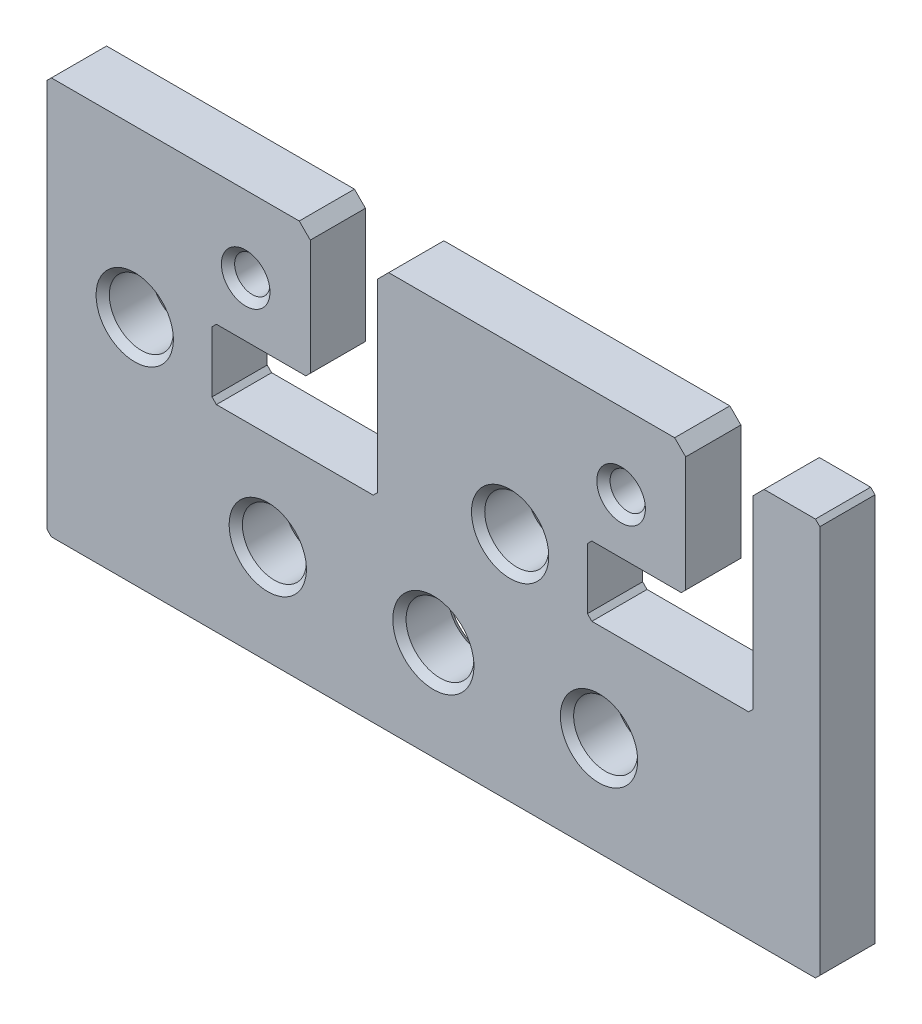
from build123d import *

# Parameters (mm, degrees)
SKETCH_1_R          = 3.075
SKETCH_1_R_2        = 2.9
SKETCH_1_R_3        = 1.6
EXTRUDE_1_DEPTH     = 5
CHAMFER_2_SIZE      = 0.4
CHAMFER_3_SIZE      = 1
CHAMFER_5_SIZE      = 0.4
SKETCH_2_R          = 1.4
CUT_EXTRUDE_1_DEPTH = 10
CHAMFER_4_SIZE      = 0.6


with BuildPart() as part:
    # Sketch 1 → Extrude 1 (new body)
    with BuildSketch(Plane.XY):
        Polygon((-14.098098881, -2.622176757), (55.901901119, -2.622176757), (55.901901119, 33.377823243), (49.851901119, 33.377823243), (49.851901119, 15.227823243), (34.851901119, 15.227823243), (34.851901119, 21.527823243), (43.751901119, 21.527823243), (43.751901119, 33.377823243), (15.851901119, 33.377823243), (15.851901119, 15.227823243), (0.851901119, 15.227823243), (0.851901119, 21.527823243), (9.751901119, 21.527823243), (9.751901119, 33.377823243), (-14.098098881, 33.377823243), align=None)
        with Locations((20.901901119, 6.377823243)):
            Circle(SKETCH_1_R, mode=Mode.SUBTRACT)
        with Locations((35.901901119, 6.377823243)):
            Circle(SKETCH_1_R_2, mode=Mode.SUBTRACT)
        with Locations((5.901901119, 6.377823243)):
            Circle(SKETCH_1_R_2, mode=Mode.SUBTRACT)
        with Locations((3.901901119, 26.477823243)):
            Circle(SKETCH_1_R_3, mode=Mode.SUBTRACT)
        with Locations((37.901901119, 26.477823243)):
            Circle(SKETCH_1_R_3, mode=Mode.SUBTRACT)
        with Locations((27.851901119, 18.377823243)):
            Circle(SKETCH_1_R_2, mode=Mode.SUBTRACT)
        with Locations((-6.148098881, 18.377823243)):
            Circle(SKETCH_1_R_2, mode=Mode.SUBTRACT)
    extrude(amount=EXTRUDE_1_DEPTH)

    # Chamfer 2
    chamfer_2_edges = [part.edges().sort_by_distance(p)[0] for p in [
        (-14.098098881, 33.377823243, 2.5),
        (9.751901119, 21.527823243, 2.5),
        (43.751901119, 21.527823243, 2.5),
        (55.901901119, 33.377823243, 2.5),
        (55.901901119, -2.622176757, 2.5),
        (-14.098098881, -2.622176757, 2.5),
    ]]
    chamfer(chamfer_2_edges, length=CHAMFER_2_SIZE)

    # Chamfer 3
    chamfer_3_edges = [part.edges().sort_by_distance(p)[0] for p in [
        (9.751901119, 33.377823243, 2.5),
        (15.851901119, 33.377823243, 2.5),
        (43.751901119, 33.377823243, 2.5),
        (49.851901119, 33.377823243, 2.5),
    ]]
    chamfer(chamfer_3_edges, length=CHAMFER_3_SIZE)

    # Chamfer 5
    chamfer_5_edges = [part.edges().sort_by_distance(p)[0] for p in [
        (0.851901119, 21.527823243, 2.5),
        (0.851901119, 15.227823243, 2.5),
        (15.851901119, 15.227823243, 2.5),
        (34.851901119, 21.527823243, 2.5),
        (34.851901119, 15.227823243, 2.5),
        (49.851901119, 15.227823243, 2.5),
    ]]
    chamfer(chamfer_5_edges, length=CHAMFER_5_SIZE)

    # Sketch 2 → Cut-Extrude 1 (cut)
    with BuildSketch(Plane.XZ.offset(2.622176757)):
        with Locations(Location((-1.698098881, 2.5, 0), (0, 0, 270))):
            Circle(SKETCH_2_R)
        with Locations(Location((43.501901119, 2.5, 0), (0, 0, 270))):
            Circle(SKETCH_2_R)
    extrude(amount=-CUT_EXTRUDE_1_DEPTH, mode=Mode.SUBTRACT)

    # Chamfer 4
    chamfer_4_edges = [part.edges().sort_by_distance(p)[0] for p in [
        (-1.698098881, -2.622176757, 3.9),
        (43.501901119, -2.622176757, 3.9),
        (17.826901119, 6.377823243, 0),
        (17.826901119, 6.377823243, 5),
        (33.001901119, 6.377823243, 0),
        (33.001901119, 6.377823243, 5),
        (3.001901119, 6.377823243, 0),
        (3.001901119, 6.377823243, 5),
        (2.301901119, 26.477823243, 0),
        (2.301901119, 26.477823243, 5),
        (36.301901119, 26.477823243, 0),
        (36.301901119, 26.477823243, 5),
        (24.951901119, 18.377823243, 0),
        (24.951901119, 18.377823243, 5),
        (-9.048098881, 18.377823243, 0),
        (-9.048098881, 18.377823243, 5),
    ]]
    chamfer(chamfer_4_edges, length=CHAMFER_4_SIZE)


solid = part.part
